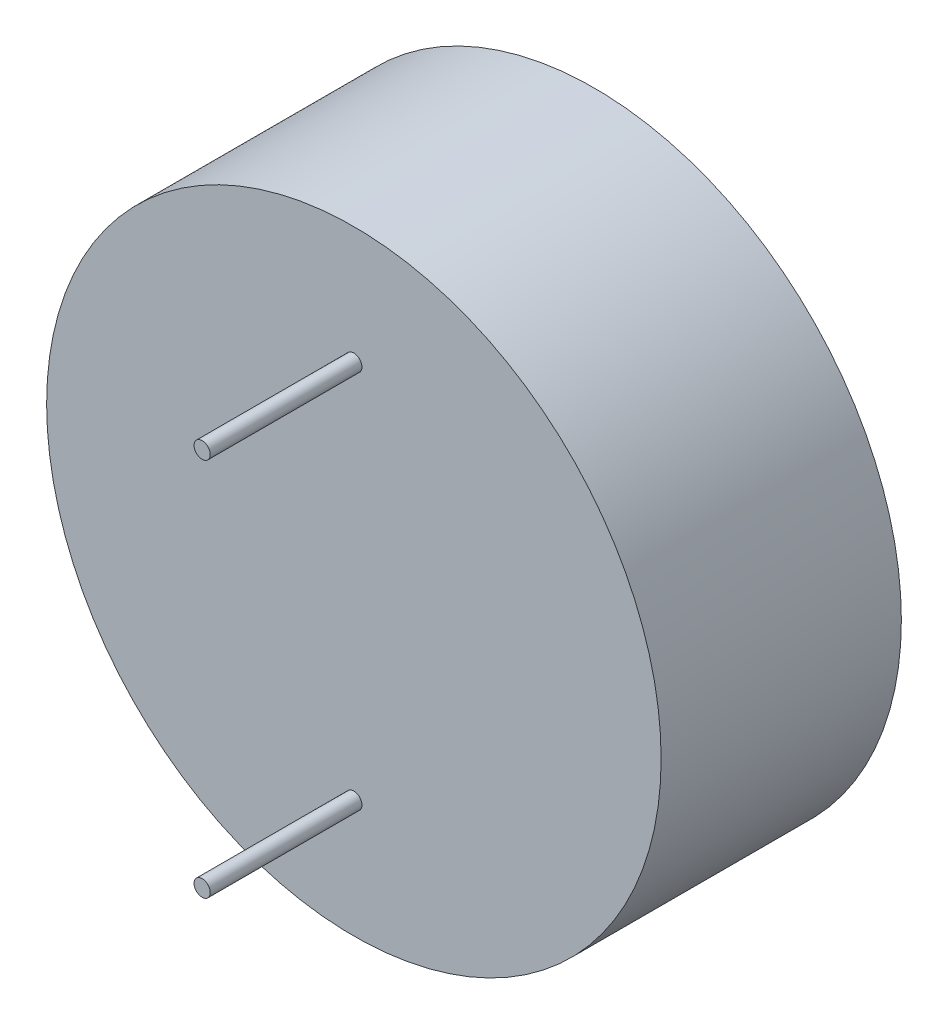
from build123d import *

# Parameters (mm, degrees)
ESQUISSE1_R             = 12.15
BASE_EXTRUSION_DEPTH    = 9.5
ESQUISSE2_R             = 1.75
ENL_V_MAT_EXTRU_1_DEPTH = 4
ESQUISSE3_R             = 0.32
BOSS_EXTRU_1_DEPTH      = 6


with BuildPart() as part:
    # Esquisse1 → Base-Extrusion (new body)
    with BuildSketch(Plane.XY):
        Circle(ESQUISSE1_R)
    extrude(amount=BASE_EXTRUSION_DEPTH)

    # Esquisse2 → Enl_v. mat.-Extru.1 (cut)
    with BuildSketch(Plane(origin=(0, 0, 0), x_dir=(-1, 0, 0), z_dir=(0, 0, -1))):
        Circle(ESQUISSE2_R)
    extrude(amount=-ENL_V_MAT_EXTRU_1_DEPTH, mode=Mode.SUBTRACT)

    # Esquisse3 → Boss.-Extru.1 (add)
    with BuildSketch(Plane.XY.offset(9.5)):
        with Locations((0, 7.5)):
            Circle(ESQUISSE3_R)
        with Locations((0, -7.5)):
            Circle(ESQUISSE3_R)
    extrude(amount=BOSS_EXTRU_1_DEPTH)


solid = part.part
